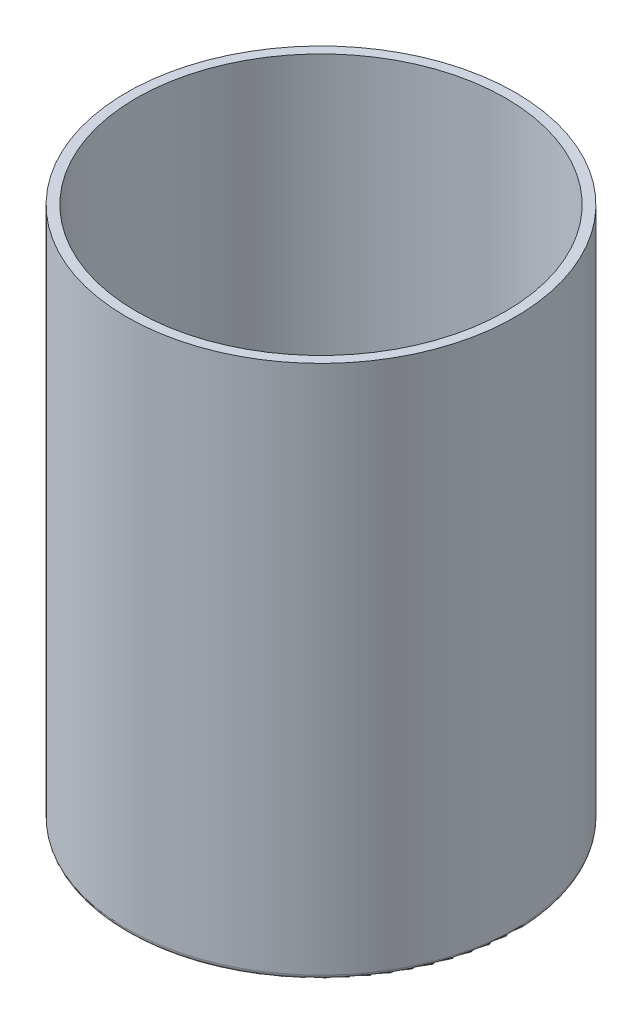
ISO-10303-21;
HEADER;
FILE_DESCRIPTION(('STEP AP214'),'2;1');
FILE_NAME('part.step','',(''),(''),'','','');
FILE_SCHEMA(('AUTOMOTIVE_DESIGN { 1 0 10303 214 1 1 1 1 }'));
ENDSEC;
DATA;
#1=APPLICATION_CONTEXT('core data for automotive mechanical design processes');
#2=APPLICATION_PROTOCOL_DEFINITION('international standard','automotive_design',2000,#1);
#3=PRODUCT_CONTEXT('',#1,'mechanical');
#4=PRODUCT('Part','Part','',(#3));
#5=PRODUCT_RELATED_PRODUCT_CATEGORY('part','',(#4));
#6=PRODUCT_DEFINITION_FORMATION('','',#4);
#7=PRODUCT_DEFINITION_CONTEXT('part definition',#1,'design');
#8=PRODUCT_DEFINITION('design','',#6,#7);
#9=PRODUCT_DEFINITION_SHAPE('','',#8);
#10=(LENGTH_UNIT() NAMED_UNIT(*) SI_UNIT(.MILLI.,.METRE.));
#11=(NAMED_UNIT(*) PLANE_ANGLE_UNIT() SI_UNIT($,.RADIAN.));
#12=(NAMED_UNIT(*) SI_UNIT($,.STERADIAN.) SOLID_ANGLE_UNIT());
#13=UNCERTAINTY_MEASURE_WITH_UNIT(LENGTH_MEASURE(1.E-05),#10,'distance_accuracy_value','');
#14=(GEOMETRIC_REPRESENTATION_CONTEXT(3) GLOBAL_UNCERTAINTY_ASSIGNED_CONTEXT((#13)) GLOBAL_UNIT_ASSIGNED_CONTEXT((#10,
#11,#12)) REPRESENTATION_CONTEXT('',''));
#15=CARTESIAN_POINT('',(0.,0.,0.));
#16=DIRECTION('',(0.,0.,1.));
#17=DIRECTION('',(1.,0.,0.));
#18=AXIS2_PLACEMENT_3D('',#15,#16,#17);
#19=CARTESIAN_POINT('',(0.,-110.,0.));
#20=DIRECTION('',(0.,1.,0.));
#21=DIRECTION('',(0.,0.,1.));
#22=AXIS2_PLACEMENT_3D('',#19,#20,#21);
#23=CYLINDRICAL_SURFACE('',#22,40.);
#24=CARTESIAN_POINT('',(0.,-109.,0.));
#25=DIRECTION('',(0.,1.,0.));
#26=DIRECTION('',(0.,0.,1.));
#27=AXIS2_PLACEMENT_3D('',#24,#25,#26);
#28=CIRCLE('',#27,40.);
#29=CARTESIAN_POINT('',(0.,-109.,40.));
#30=VERTEX_POINT('',#29);
#31=EDGE_CURVE('E49',#30,#30,#28,.T.);
#32=ORIENTED_EDGE('',*,*,#31,.T.);
#33=EDGE_LOOP('',(#32));
#34=FACE_BOUND('',#33,.T.);
#35=CARTESIAN_POINT('',(0.,0.,0.));
#36=DIRECTION('',(0.,1.,0.));
#37=DIRECTION('',(0.,0.,1.));
#38=AXIS2_PLACEMENT_3D('',#35,#36,#37);
#39=CIRCLE('',#38,40.);
#40=CARTESIAN_POINT('',(0.,0.,40.));
#41=VERTEX_POINT('',#40);
#42=EDGE_CURVE('E54',#41,#41,#39,.T.);
#43=ORIENTED_EDGE('',*,*,#42,.F.);
#44=EDGE_LOOP('',(#43));
#45=FACE_BOUND('',#44,.T.);
#46=ADVANCED_FACE('F41',(#34,#45),#23,.T.);
#47=CARTESIAN_POINT('',(0.,-110.,0.));
#48=DIRECTION('',(0.,1.,0.));
#49=DIRECTION('',(0.,0.,1.));
#50=AXIS2_PLACEMENT_3D('',#47,#48,#49);
#51=PLANE('',#50);
#52=CARTESIAN_POINT('',(0.,-110.,0.));
#53=DIRECTION('',(0.,1.,0.));
#54=DIRECTION('',(0.,0.,1.));
#55=AXIS2_PLACEMENT_3D('',#52,#53,#54);
#56=CIRCLE('',#55,39.);
#57=CARTESIAN_POINT('',(0.,-110.,39.));
#58=VERTEX_POINT('',#57);
#59=EDGE_CURVE('E10',#58,#58,#56,.F.);
#60=ORIENTED_EDGE('',*,*,#59,.T.);
#61=EDGE_LOOP('',(#60));
#62=FACE_BOUND('',#61,.T.);
#63=ADVANCED_FACE('F81',(#62),#51,.F.);
#64=CARTESIAN_POINT('',(0.,0.,0.));
#65=DIRECTION('',(0.,1.,0.));
#66=DIRECTION('',(0.,0.,1.));
#67=AXIS2_PLACEMENT_3D('',#64,#65,#66);
#68=PLANE('',#67);
#69=CARTESIAN_POINT('',(0.,0.,0.));
#70=DIRECTION('',(0.,1.,0.));
#71=DIRECTION('',(0.,0.,1.));
#72=AXIS2_PLACEMENT_3D('',#69,#70,#71);
#73=CIRCLE('',#72,38.);
#74=CARTESIAN_POINT('',(0.,0.,38.));
#75=VERTEX_POINT('',#74);
#76=EDGE_CURVE('E62',#75,#75,#73,.T.);
#77=ORIENTED_EDGE('',*,*,#76,.F.);
#78=EDGE_LOOP('',(#77));
#79=FACE_BOUND('',#78,.T.);
#80=ORIENTED_EDGE('',*,*,#42,.T.);
#81=EDGE_LOOP('',(#80));
#82=FACE_BOUND('',#81,.T.);
#83=ADVANCED_FACE('F75',(#79,#82),#68,.T.);
#84=CARTESIAN_POINT('',(0.,-110.,0.));
#85=DIRECTION('',(0.,1.,0.));
#86=DIRECTION('',(0.,0.,1.));
#87=AXIS2_PLACEMENT_3D('',#84,#85,#86);
#88=CYLINDRICAL_SURFACE('',#87,38.);
#89=CARTESIAN_POINT('',(0.,-108.,0.));
#90=DIRECTION('',(0.,1.,0.));
#91=DIRECTION('',(0.,0.,1.));
#92=AXIS2_PLACEMENT_3D('',#89,#90,#91);
#93=CIRCLE('',#92,38.);
#94=CARTESIAN_POINT('',(0.,-108.,38.));
#95=VERTEX_POINT('',#94);
#96=EDGE_CURVE('E59',#95,#95,#93,.T.);
#97=ORIENTED_EDGE('',*,*,#96,.F.);
#98=EDGE_LOOP('',(#97));
#99=FACE_BOUND('',#98,.T.);
#100=ORIENTED_EDGE('',*,*,#76,.T.);
#101=EDGE_LOOP('',(#100));
#102=FACE_BOUND('',#101,.T.);
#103=ADVANCED_FACE('F72',(#99,#102),#88,.F.);
#104=CARTESIAN_POINT('',(0.,-108.,0.));
#105=DIRECTION('',(0.,1.,0.));
#106=DIRECTION('',(0.,0.,1.));
#107=AXIS2_PLACEMENT_3D('',#104,#105,#106);
#108=PLANE('',#107);
#109=ORIENTED_EDGE('',*,*,#96,.T.);
#110=EDGE_LOOP('',(#109));
#111=FACE_BOUND('',#110,.T.);
#112=ADVANCED_FACE('F70',(#111),#108,.T.);
#113=CARTESIAN_POINT('',(0.,-109.,0.));
#114=DIRECTION('',(0.,1.,0.));
#115=DIRECTION('',(0.,0.,1.));
#116=AXIS2_PLACEMENT_3D('',#113,#114,#115);
#117=TOROIDAL_SURFACE('',#116,39.,1.);
#118=ORIENTED_EDGE('',*,*,#59,.F.);
#119=EDGE_LOOP('',(#118));
#120=FACE_BOUND('',#119,.T.);
#121=ORIENTED_EDGE('',*,*,#31,.F.);
#122=EDGE_LOOP('',(#121));
#123=FACE_BOUND('',#122,.T.);
#124=ADVANCED_FACE('F43',(#120,#123),#117,.T.);
#125=CLOSED_SHELL('',(#46,#63,#83,#103,#112,#124));
#126=MANIFOLD_SOLID_BREP('B2',#125);
#127=ADVANCED_BREP_SHAPE_REPRESENTATION('',(#18,#126),#14);
#128=SHAPE_DEFINITION_REPRESENTATION(#9,#127);
ENDSEC;
END-ISO-10303-21;
